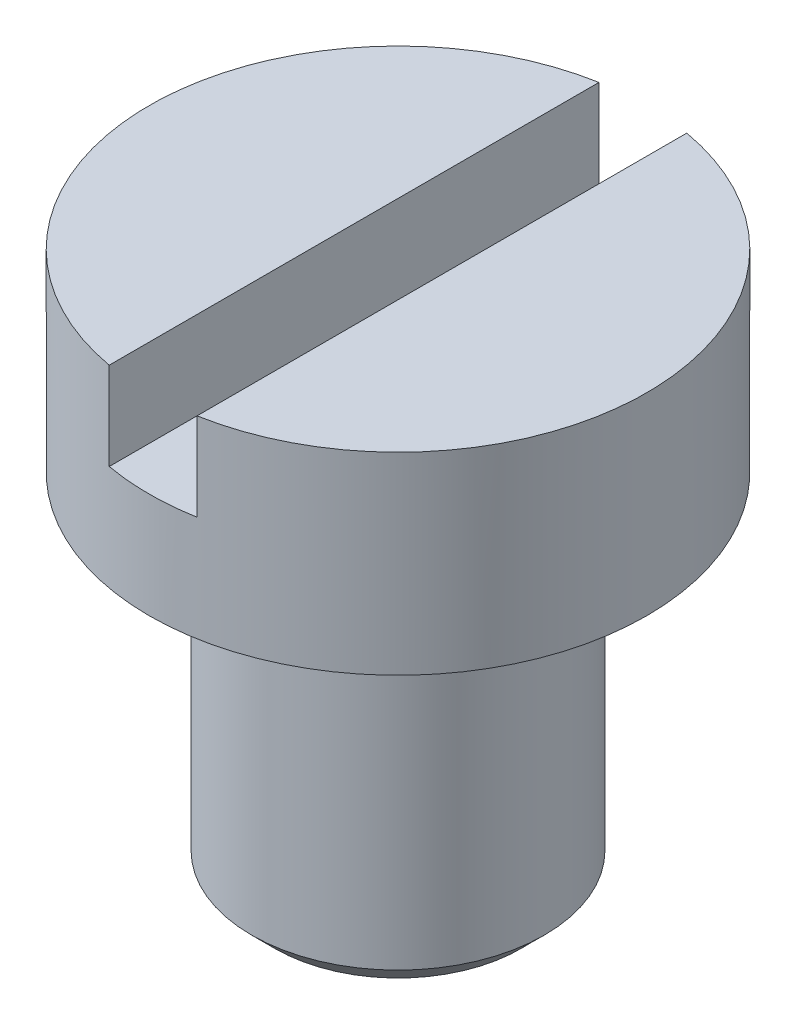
from build123d import *

# Parameters (mm, degrees)
CHANFREIN1_SIZE              = 0.8
ENL_V_MAT_EXTRU_1_DEPTH      = 10
ENL_V_MAT_EXTRU_1_DEPTH_BACK = 23.146331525
ESQUISSE2_W                  = 3
ESQUISSE2_H                  = 8.189636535


with BuildPart() as part:
    # Esquisse1 → Base-R_volution (revolve)
    with BuildSketch(Plane.XY, mode=Mode.PRIVATE) as base_r_volution_sk:
        Polygon((0, 18.6), (8.5, 18.6), (8.5, 12), (5, 12), (5, 0), (0, 0), align=None)
    revolve(base_r_volution_sk.sketch.rotate(Axis((0, -40.714025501, 0), (0, 1, 0)), 90), axis=Axis((0, -40.714025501, 0), (0, 1, 0)))

    # Chanfrein1
    chanfrein1_edges = [part.edges().sort_by_distance(p)[0] for p in [
        (0, 0, 5),
    ]]
    chamfer(chanfrein1_edges, length=CHANFREIN1_SIZE)

    # Esquisse2 → Enl_v. mat.-Extru.1 (cut, two sides: drawn at the far end of the back side and taken through both)
    with BuildSketch(Plane.XY.offset(-ENL_V_MAT_EXTRU_1_DEPTH_BACK)):
        with Locations((0, 19.694818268)):
            Rectangle(ESQUISSE2_W, ESQUISSE2_H)
    extrude(amount=ENL_V_MAT_EXTRU_1_DEPTH + ENL_V_MAT_EXTRU_1_DEPTH_BACK, mode=Mode.SUBTRACT)


solid = part.part
